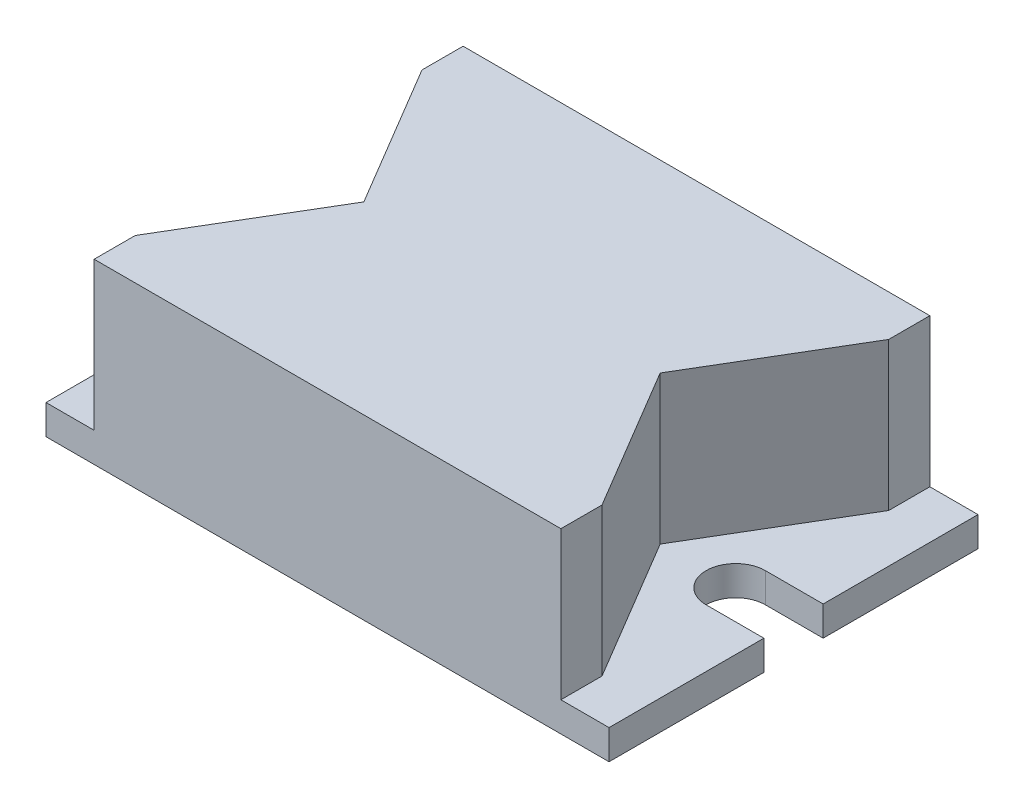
from build123d import *

# Parameters (mm, degrees)
SKETCH1_R           = 2
BOSS_EXTRUDE1_DEPTH = 2
BOSS_EXTRUDE2_DEPTH = 12


with BuildPart() as part:
    # Sketch1 → Boss-Extrude1 (new body)
    # profile 1 of 3: a face of its own
    with BuildSketch(Plane(origin=(0, 0, 0), x_dir=(1, 0, 0), z_dir=(0, 1, 0))):
        with BuildLine():
            Line((19, 12.45), (15.75, 12.45))
            Line((15.75, 12.45), (15.75, 9.674743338))
            Line((15.75, 9.674743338), (10, 0))
            Line((10, 0), (15.75, -9.674743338))
            Line((15.75, -9.674743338), (15.75, -12.45))
            Line((15.75, -12.45), (19, -12.45))
            Line((19, -12.45), (19, -2))
            Line((19, -2), (15.1, -2))
            ThreePointArc((15.1, -2), (13.1, 0), (15.1, 2))
            Line((15.1, 2), (19, 2))
            Line((19, 2), (19, 12.45))
        make_face()
    # profile 2 of 3: a face of its own
    with BuildSketch(Plane(origin=(0, 0, 0), x_dir=(1, 0, 0), z_dir=(0, 1, 0))):
        Polygon((15.75, 12.45), (-15.75, 12.45), (-15.75, 9.674743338), (-10, 0), (-15.75, -9.674743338), (-15.75, -12.45), (15.75, -12.45), (15.75, -9.674743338), (10, 0), (15.75, 9.674743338), align=None)
    # profile 3 of 3: a face of its own
    with BuildSketch(Plane(origin=(0, 0, 0), x_dir=(1, 0, 0), z_dir=(0, 1, 0))):
        Polygon((-15.75, 12.45), (-19, 12.45), (-19, -12.45), (-15.75, -12.45), (-15.75, -9.674743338), (-10, 0), (-15.75, 9.674743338), align=None)
        with Locations(Location((-15.1, 0, 0), (0, 0, 270))):
            Circle(SKETCH1_R, mode=Mode.SUBTRACT)
    extrude(amount=BOSS_EXTRUDE1_DEPTH)

    # Sketch1_3 → Boss-Extrude2 (add)
    with BuildSketch(Plane(origin=(0, 0, 0), x_dir=(1, 0, 0), z_dir=(0, 1, 0))):
        Polygon((15.75, 12.45), (-15.75, 12.45), (-15.75, 9.674743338), (-10, 0), (-15.75, -9.674743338), (-15.75, -12.45), (15.75, -12.45), (15.75, -9.674743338), (10, 0), (15.75, 9.674743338), align=None)
    extrude(amount=BOSS_EXTRUDE2_DEPTH)


solid = part.part
